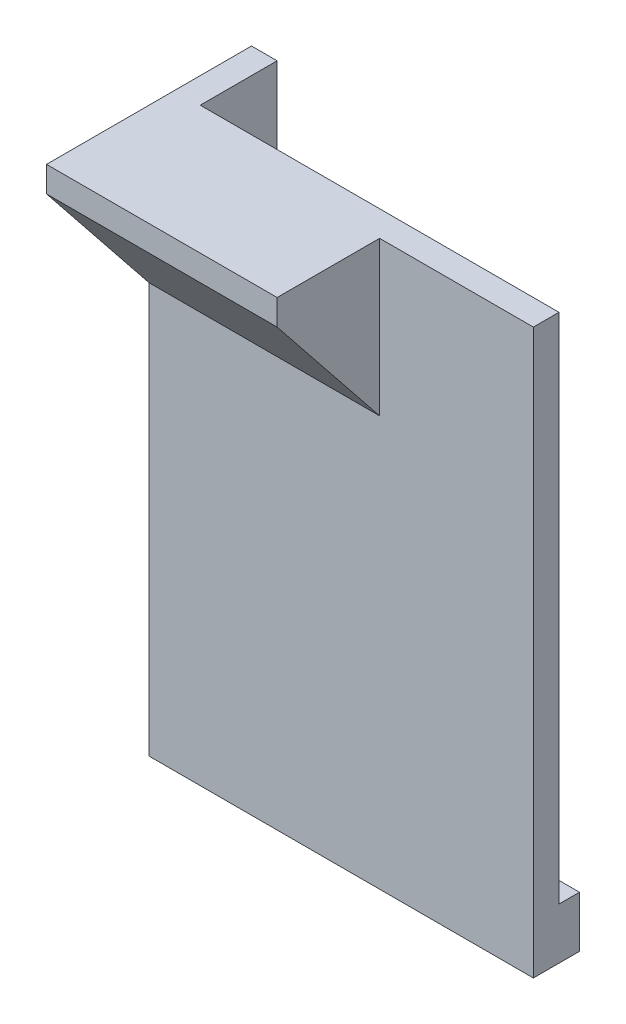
from build123d import *

# Parameters (mm, degrees)
LINEAR_AUSTRAGEN_D_NN1_DEPTH      = 100
LINEAR_AUSTRAGEN_D_NN1_DEPTH_BACK = 10
LINEAR_AUSTRAGEN2_DEPTH           = 40
LINEAR_AUSTRAGEN2_DEPTH_BACK      = 5
SKIZZE2_W                         = 20
SKIZZE2_H                         = 9
LINEAR_AUSTRAGEN3_DEPTH           = 10


with BuildPart() as part:
    # Skizze1 → Linear-Austragen-D_nn1 (new, two sides: drawn at the far end of the back side and taken through both)
    with BuildSketch(Plane(origin=(0, 0, 0), x_dir=(1, 0, 0), z_dir=(0, 1, 0)).offset(-LINEAR_AUSTRAGEN_D_NN1_DEPTH_BACK)):
        Polygon((0, 15), (0, 0), (70, 0), (70, -5), (-5, -5), (-5, 15), align=None)
    extrude(amount=LINEAR_AUSTRAGEN_D_NN1_DEPTH + LINEAR_AUSTRAGEN_D_NN1_DEPTH_BACK)

    # Skizze3 → Linear austragen2 (add, two sides: drawn at the far end of the back side and taken through both)
    with BuildSketch(Plane(origin=(0, 0, 0), x_dir=(0, 0, -1), z_dir=(1, 0, 0)).offset(-LINEAR_AUSTRAGEN2_DEPTH_BACK)):
        Polygon((-5, 70), (-5, 100), (-25, 100), (-25, 95), align=None)
    extrude(amount=LINEAR_AUSTRAGEN2_DEPTH + LINEAR_AUSTRAGEN2_DEPTH_BACK)

    # Skizze2 → Linear austragen3 (add)
    with BuildSketch(Plane(origin=(0, 0, 0), x_dir=(1, 0, 0), z_dir=(0, 1, 0))):
        with Locations((10, -0.5)):
            Rectangle(SKIZZE2_W, SKIZZE2_H)
        with Locations((60, -0.5)):
            Rectangle(SKIZZE2_W, SKIZZE2_H)
    extrude(amount=-LINEAR_AUSTRAGEN3_DEPTH)


solid = part.part
